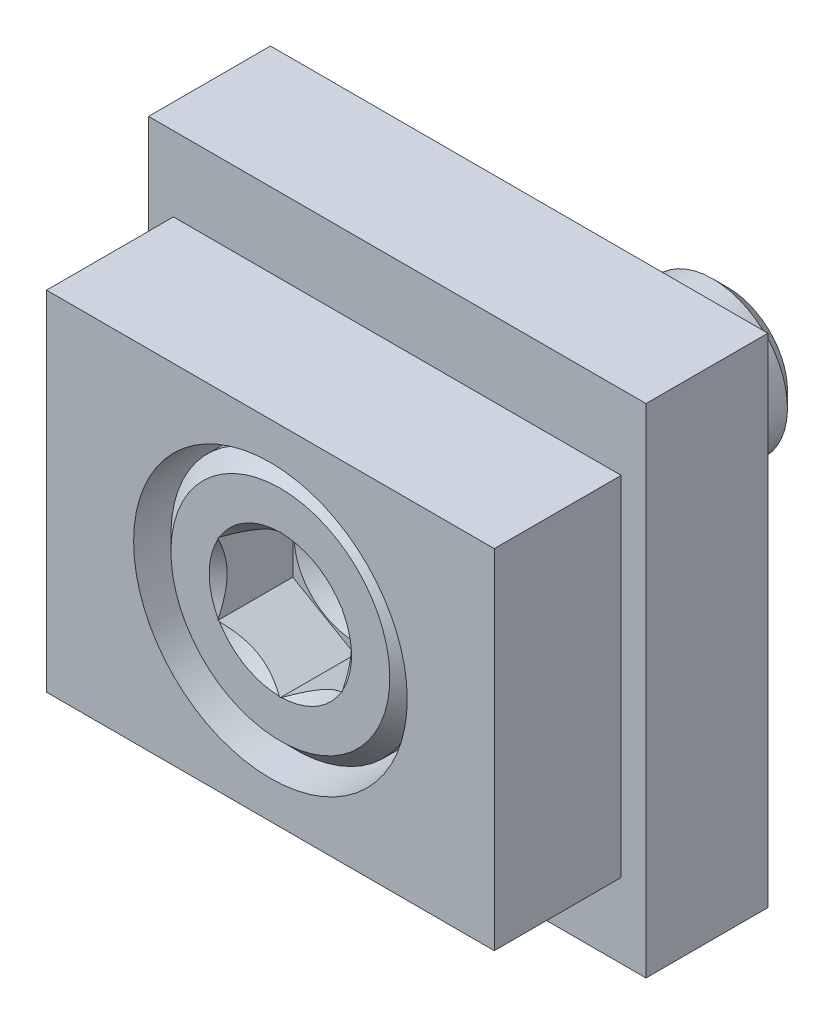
ISO-10303-21;
HEADER;
FILE_DESCRIPTION(('STEP AP214'),'2;1');
FILE_NAME('part.step','',(''),(''),'','','');
FILE_SCHEMA(('AUTOMOTIVE_DESIGN { 1 0 10303 214 1 1 1 1 }'));
ENDSEC;
DATA;
#1=APPLICATION_CONTEXT('core data for automotive mechanical design processes');
#2=APPLICATION_PROTOCOL_DEFINITION('international standard','automotive_design',2000,#1);
#3=PRODUCT_CONTEXT('',#1,'mechanical');
#4=PRODUCT('Part','Part','',(#3));
#5=PRODUCT_RELATED_PRODUCT_CATEGORY('part','',(#4));
#6=PRODUCT_DEFINITION_FORMATION('','',#4);
#7=PRODUCT_DEFINITION_CONTEXT('part definition',#1,'design');
#8=PRODUCT_DEFINITION('design','',#6,#7);
#9=PRODUCT_DEFINITION_SHAPE('','',#8);
#10=(LENGTH_UNIT() NAMED_UNIT(*) SI_UNIT(.MILLI.,.METRE.));
#11=(NAMED_UNIT(*) PLANE_ANGLE_UNIT() SI_UNIT($,.RADIAN.));
#12=(NAMED_UNIT(*) SI_UNIT($,.STERADIAN.) SOLID_ANGLE_UNIT());
#13=UNCERTAINTY_MEASURE_WITH_UNIT(LENGTH_MEASURE(1.E-05),#10,'distance_accuracy_value','');
#14=(GEOMETRIC_REPRESENTATION_CONTEXT(3) GLOBAL_UNCERTAINTY_ASSIGNED_CONTEXT((#13)) GLOBAL_UNIT_ASSIGNED_CONTEXT((#10,
#11,#12)) REPRESENTATION_CONTEXT('',''));
#15=CARTESIAN_POINT('',(0.,0.,0.));
#16=DIRECTION('',(0.,0.,1.));
#17=DIRECTION('',(1.,0.,0.));
#18=AXIS2_PLACEMENT_3D('',#15,#16,#17);
#19=CARTESIAN_POINT('',(2.3865,0.,-8.4));
#20=DIRECTION('',(0.,0.,1.));
#21=DIRECTION('',(1.,0.,0.));
#22=AXIS2_PLACEMENT_3D('',#19,#20,#21);
#23=PLANE('',#22);
#24=CARTESIAN_POINT('',(0.,0.,-8.4));
#25=DIRECTION('',(0.,0.,-1.));
#26=DIRECTION('',(0.,1.,0.));
#27=AXIS2_PLACEMENT_3D('',#24,#25,#26);
#28=CIRCLE('',#27,2.3865);
#29=CARTESIAN_POINT('',(0.,2.3865,-8.4));
#30=VERTEX_POINT('',#29);
#31=EDGE_CURVE('E883',#30,#30,#28,.T.);
#32=ORIENTED_EDGE('',*,*,#31,.T.);
#33=EDGE_LOOP('',(#32));
#34=FACE_BOUND('',#33,.T.);
#35=ADVANCED_FACE('F14',(#34),#23,.F.);
#36=CARTESIAN_POINT('',(0.,0.,-7.7865));
#37=DIRECTION('',(0.,0.,1.));
#38=DIRECTION('',(0.,-1.,0.));
#39=AXIS2_PLACEMENT_3D('',#36,#37,#38);
#40=CONICAL_SURFACE('',#39,3.,0.7853981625);
#41=ORIENTED_EDGE('',*,*,#31,.F.);
#42=EDGE_LOOP('',(#41));
#43=FACE_BOUND('',#42,.T.);
#44=CARTESIAN_POINT('',(0.,0.,-7.7865));
#45=DIRECTION('',(0.,0.,-1.));
#46=DIRECTION('',(0.,1.,0.));
#47=AXIS2_PLACEMENT_3D('',#44,#45,#46);
#48=CIRCLE('',#47,3.);
#49=CARTESIAN_POINT('',(0.,3.,-7.7865));
#50=VERTEX_POINT('',#49);
#51=EDGE_CURVE('E905',#50,#50,#48,.T.);
#52=ORIENTED_EDGE('',*,*,#51,.T.);
#53=EDGE_LOOP('',(#52));
#54=FACE_BOUND('',#53,.T.);
#55=ADVANCED_FACE('F619',(#43,#54),#40,.T.);
#56=CARTESIAN_POINT('',(0.,0.,3.6));
#57=DIRECTION('',(0.,0.,-1.));
#58=DIRECTION('',(0.,1.,0.));
#59=AXIS2_PLACEMENT_3D('',#56,#57,#58);
#60=CYLINDRICAL_SURFACE('',#59,3.);
#61=ORIENTED_EDGE('',*,*,#51,.F.);
#62=EDGE_LOOP('',(#61));
#63=FACE_BOUND('',#62,.T.);
#64=CARTESIAN_POINT('',(0.,0.,3.6));
#65=DIRECTION('',(0.,0.,-1.));
#66=DIRECTION('',(0.,1.,0.));
#67=AXIS2_PLACEMENT_3D('',#64,#65,#66);
#68=CIRCLE('',#67,3.);
#69=CARTESIAN_POINT('',(0.,3.,3.6));
#70=VERTEX_POINT('',#69);
#71=EDGE_CURVE('E879',#70,#70,#68,.T.);
#72=ORIENTED_EDGE('',*,*,#71,.T.);
#73=EDGE_LOOP('',(#72));
#74=FACE_BOUND('',#73,.T.);
#75=ADVANCED_FACE('F407',(#63,#74),#60,.T.);
#76=CARTESIAN_POINT('',(4.69,0.,3.6));
#77=DIRECTION('',(0.,0.,1.));
#78=DIRECTION('',(1.,0.,0.));
#79=AXIS2_PLACEMENT_3D('',#76,#77,#78);
#80=PLANE('',#79);
#81=ORIENTED_EDGE('',*,*,#71,.F.);
#82=EDGE_LOOP('',(#81));
#83=FACE_BOUND('',#82,.T.);
#84=CARTESIAN_POINT('',(0.,0.,3.6));
#85=DIRECTION('',(0.,0.,1.));
#86=DIRECTION('',(1.,0.,0.));
#87=AXIS2_PLACEMENT_3D('',#84,#85,#86);
#88=CIRCLE('',#87,3.3);
#89=CARTESIAN_POINT('',(3.3,0.,3.6));
#90=VERTEX_POINT('',#89);
#91=EDGE_CURVE('E9',#90,#90,#88,.T.);
#92=ORIENTED_EDGE('',*,*,#91,.F.);
#93=EDGE_LOOP('',(#92));
#94=FACE_BOUND('',#93,.T.);
#95=ADVANCED_FACE('F403',(#83,#94),#80,.F.);
#96=CARTESIAN_POINT('',(0.,0.,9.19));
#97=DIRECTION('',(0.,0.,1.));
#98=DIRECTION('',(0.,-1.,0.));
#99=AXIS2_PLACEMENT_3D('',#96,#97,#98);
#100=CONICAL_SURFACE('',#99,2.45,0.785398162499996);
#101=CARTESIAN_POINT('',(0.,0.,9.6));
#102=DIRECTION('',(0.,0.,-1.));
#103=DIRECTION('',(0.,1.,0.));
#104=AXIS2_PLACEMENT_3D('',#101,#102,#103);
#105=CIRCLE('',#104,2.86);
#106=CARTESIAN_POINT('',(-0.0470037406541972,-2.85961372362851,9.6));
#107=VERTEX_POINT('',#106);
#108=CARTESIAN_POINT('',(-2.45299625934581,-1.47051329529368,9.6));
#109=VERTEX_POINT('',#108);
#110=EDGE_CURVE('E38',#107,#109,#105,.T.);
#111=ORIENTED_EDGE('',*,*,#110,.F.);
#112=CARTESIAN_POINT('',(-0.047003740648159,-2.8596137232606,9.60000000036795));
#113=CARTESIAN_POINT('',(-0.0960797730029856,-2.83127575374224,9.57247848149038));
#114=CARTESIAN_POINT('',(-0.145612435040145,-2.80268798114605,9.54598950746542));
#115=CARTESIAN_POINT('',(-0.243979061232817,-2.74594253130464,9.49630136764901));
#116=CARTESIAN_POINT('',(-0.292782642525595,-2.71780150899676,9.47302278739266));
#117=CARTESIAN_POINT('',(-0.389910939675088,-2.66182010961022,9.42974375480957));
#118=CARTESIAN_POINT('',(-0.438210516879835,-2.63399353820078,9.40966951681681));
#119=CARTESIAN_POINT('',(-0.53456612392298,-2.5784839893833,9.37280301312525));
#120=CARTESIAN_POINT('',(-0.582603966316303,-2.55081141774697,9.35594804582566));
#121=CARTESIAN_POINT('',(-0.656982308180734,-2.5078792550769,9.33234443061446));
#122=CARTESIAN_POINT('',(-0.683087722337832,-2.49279481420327,9.32452566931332));
#123=CARTESIAN_POINT('',(-0.735037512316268,-2.46274559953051,9.3099345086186));
#124=CARTESIAN_POINT('',(-0.760878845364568,-2.44778311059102,9.3031466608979));
#125=CARTESIAN_POINT('',(-0.812367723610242,-2.41796603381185,9.29062096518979));
#126=CARTESIAN_POINT('',(-0.838012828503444,-2.40311291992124,9.28486960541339));
#127=CARTESIAN_POINT('',(-0.889171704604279,-2.37349136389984,9.27441329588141));
#128=CARTESIAN_POINT('',(-0.914683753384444,-2.35872382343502,9.2696973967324));
#129=CARTESIAN_POINT('',(-0.965638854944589,-2.329245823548,9.26130967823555));
#130=CARTESIAN_POINT('',(-0.991080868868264,-2.3145358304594,9.25762992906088));
#131=CARTESIAN_POINT('',(-1.04195640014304,-2.28513890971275,9.25131113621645));
#132=CARTESIAN_POINT('',(-1.06738946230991,-2.2704521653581,9.24866758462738));
#133=CARTESIAN_POINT('',(-1.11830607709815,-2.2410622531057,9.24441802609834));
#134=CARTESIAN_POINT('',(-1.14378957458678,-2.22635910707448,9.24281120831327));
#135=CARTESIAN_POINT('',(-1.19486287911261,-2.19688952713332,9.24062998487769));
#136=CARTESIAN_POINT('',(-1.22045277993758,-2.18212303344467,9.24005859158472));
#137=CARTESIAN_POINT('',(-1.27170421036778,-2.15253214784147,9.23994960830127));
#138=CARTESIAN_POINT('',(-1.29736572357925,-2.13770771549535,9.24041513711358));
#139=CARTESIAN_POINT('',(-1.34859834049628,-2.1081187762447,9.24240091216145));
#140=CARTESIAN_POINT('',(-1.37416951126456,-2.09335421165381,9.24391855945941));
#141=CARTESIAN_POINT('',(-1.42528936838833,-2.06385520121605,9.24800323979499));
#142=CARTESIAN_POINT('',(-1.45083798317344,-2.04912081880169,9.25057162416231));
#143=CARTESIAN_POINT('',(-1.50197785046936,-2.01964840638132,9.2567541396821));
#144=CARTESIAN_POINT('',(-1.52756867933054,-2.00491072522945,9.2603734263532));
#145=CARTESIAN_POINT('',(-1.57885400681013,-1.97539279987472,9.26865400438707));
#146=CARTESIAN_POINT('',(-1.60454751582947,-1.96061327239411,9.27332395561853));
#147=CARTESIAN_POINT('',(-1.65609495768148,-1.93096789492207,9.2837020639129));
#148=CARTESIAN_POINT('',(-1.68194714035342,-1.91610312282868,9.28942195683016));
#149=CARTESIAN_POINT('',(-1.73386520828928,-1.88624143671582,9.30189861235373));
#150=CARTESIAN_POINT('',(-1.75992843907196,-1.87124590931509,9.30866970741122));
#151=CARTESIAN_POINT('',(-1.81231409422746,-1.84106600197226,9.32324024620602));
#152=CARTESIAN_POINT('',(-1.83863279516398,-1.82588305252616,9.33105594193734));
#153=CARTESIAN_POINT('',(-1.91364180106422,-1.78255453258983,9.35468680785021));
#154=CARTESIAN_POINT('',(-1.96205669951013,-1.75451895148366,9.37158922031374));
#155=CARTESIAN_POINT('',(-2.05912873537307,-1.69830505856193,9.4085923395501));
#156=CARTESIAN_POINT('',(-2.1077680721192,-1.67013700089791,9.42875483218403));
#157=CARTESIAN_POINT('',(-2.20556448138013,-1.61352740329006,9.47224944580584));
#158=CARTESIAN_POINT('',(-2.25469719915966,-1.58510071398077,9.49565516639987));
#159=CARTESIAN_POINT('',(-2.35372131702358,-1.52784654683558,9.54563601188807));
#160=CARTESIAN_POINT('',(-2.40358318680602,-1.49903742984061,9.57229092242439));
#161=CARTESIAN_POINT('',(-2.4529962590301,-1.47051329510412,9.60000000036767));
#162=B_SPLINE_CURVE_WITH_KNOTS('',3,(#112,#113,#114,#115,#116,#117,#118,#119,#120,#121,#122,
#123,#124,#125,#126,#127,#128,#129,#130,#131,#132,#133,#134,#135,#136,#137,#138,#139,#140,#141,
#142,#143,#144,#145,#146,#147,#148,#149,#150,#151,#152,#153,#154,#155,#156,#157,#158,#159,#160,
#161),.UNSPECIFIED.,.F.,.F.,(4,2,2,2,2,2,2,2,2,2,2,2,2,2,2,2,2,2,2,2,2,2,2,2,4),(0.,
0.189012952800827,0.37182547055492,0.549496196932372,0.723242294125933,0.816672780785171,
0.908524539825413,0.99907516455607,1.08861645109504,1.17745258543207,1.26589783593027,
1.35427382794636,1.44290652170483,1.53180616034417,1.62048697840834,1.70928220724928,
1.79852062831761,1.88852343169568,1.97960139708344,2.07205252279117,2.16616018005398,
2.34140408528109,2.52047512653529,2.70461803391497,2.89491567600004),.UNSPECIFIED.);
#163=EDGE_CURVE('E25',#107,#109,#162,.T.);
#164=ORIENTED_EDGE('',*,*,#163,.T.);
#165=EDGE_LOOP('',(#111,#164));
#166=FACE_BOUND('',#165,.T.);
#167=ADVANCED_FACE('F406',(#166),#100,.F.);
#168=CARTESIAN_POINT('',(0.,0.,9.19));
#169=DIRECTION('',(0.,0.,1.));
#170=DIRECTION('',(0.,-1.,0.));
#171=AXIS2_PLACEMENT_3D('',#168,#169,#170);
#172=CONICAL_SURFACE('',#171,2.45,0.785398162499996);
#173=CARTESIAN_POINT('',(0.,0.,9.6));
#174=DIRECTION('',(0.,0.,-1.));
#175=DIRECTION('',(0.,1.,0.));
#176=AXIS2_PLACEMENT_3D('',#173,#174,#175);
#177=CIRCLE('',#176,2.86);
#178=CARTESIAN_POINT('',(2.45299625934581,-1.47051329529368,9.6));
#179=VERTEX_POINT('',#178);
#180=CARTESIAN_POINT('',(0.0470037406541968,-2.85961372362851,9.6));
#181=VERTEX_POINT('',#180);
#182=EDGE_CURVE('E813',#179,#181,#177,.T.);
#183=ORIENTED_EDGE('',*,*,#182,.F.);
#184=CARTESIAN_POINT('',(2.45299625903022,-1.47051329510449,9.60000000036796));
#185=CARTESIAN_POINT('',(2.40391684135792,-1.49884540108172,9.57247848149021));
#186=CARTESIAN_POINT('',(2.35439277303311,-1.52744805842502,9.54598950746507));
#187=CARTESIAN_POINT('',(2.2560664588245,-1.58426333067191,9.49630136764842));
#188=CARTESIAN_POINT('',(2.2072938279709,-1.61245796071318,9.473022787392));
#189=CARTESIAN_POINT('',(2.110248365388,-1.66858283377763,9.42974375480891));
#190=CARTESIAN_POINT('',(2.06200005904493,-1.69649820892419,9.4096695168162));
#191=CARTESIAN_POINT('',(1.96574957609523,-1.75218983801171,9.37280301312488));
#192=CARTESIAN_POINT('',(1.91776550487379,-1.77995554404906,9.35594804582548));
#193=CARTESIAN_POINT('',(1.8433959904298,-1.82290299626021,9.33234443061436));
#194=CARTESIAN_POINT('',(1.81727977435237,-1.83796872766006,9.32452566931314));
#195=CARTESIAN_POINT('',(1.765281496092,-1.86793395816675,9.30993450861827));
#196=CARTESIAN_POINT('',(1.73940293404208,-1.88283196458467,9.3031466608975));
#197=CARTESIAN_POINT('',(1.68783614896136,-1.91251410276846,9.29062096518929));
#198=CARTESIAN_POINT('',(1.66215042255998,-1.92729685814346,9.28486960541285));
#199=CARTESIAN_POINT('',(1.61091796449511,-1.95679096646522,9.27441329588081));
#200=CARTESIAN_POINT('',(1.58537287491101,-1.97150127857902,9.26969739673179));
#201=CARTESIAN_POINT('',(1.53436662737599,-2.00089069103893,9.26130967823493));
#202=CARTESIAN_POINT('',(1.50890639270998,-2.01556912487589,9.25762992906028));
#203=CARTESIAN_POINT('',(1.4580101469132,-2.04493016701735,9.2513111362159));
#204=CARTESIAN_POINT('',(1.43257452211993,-2.05961247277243,9.24866758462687));
#205=CARTESIAN_POINT('',(1.38166380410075,-2.08901259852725,9.24441802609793));
#206=CARTESIAN_POINT('',(1.35618875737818,-2.1037303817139,9.24281120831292));
#207=CARTESIAN_POINT('',(1.30513070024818,-2.13322637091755,9.24062998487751));
#208=CARTESIAN_POINT('',(1.27954759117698,-2.14800462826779,9.24005859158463));
#209=CARTESIAN_POINT('',(1.22829541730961,-2.17759422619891,9.23994960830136));
#210=CARTESIAN_POINT('',(1.20262632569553,-2.1924055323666,9.24041513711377));
#211=CARTESIAN_POINT('',(1.15138524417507,-2.22197981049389,9.2424009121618));
#212=CARTESIAN_POINT('',(1.12581317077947,-2.23674281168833,9.24391855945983));
#213=CARTESIAN_POINT('',(1.07470634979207,-2.26626440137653,9.2480032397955));
#214=CARTESIAN_POINT('',(1.04917169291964,-2.28102295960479,9.25057162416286));
#215=CARTESIAN_POINT('',(0.998077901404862,-2.31057517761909,9.25675413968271));
#216=CARTESIAN_POINT('',(0.972519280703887,-2.32536864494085,9.26037342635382));
#217=CARTESIAN_POINT('',(0.921313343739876,-2.35502407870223,9.26865400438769));
#218=CARTESIAN_POINT('',(0.895667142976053,-2.36988554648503,9.27332395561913));
#219=CARTESIAN_POINT('',(0.844219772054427,-2.39970425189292,9.28370206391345));
#220=CARTESIAN_POINT('',(0.818420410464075,-2.41466051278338,9.28942195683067));
#221=CARTESIAN_POINT('',(0.766600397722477,-2.44469203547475,9.30189861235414));
#222=CARTESIAN_POINT('',(0.740582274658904,-2.45976569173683,9.30866970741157));
#223=CARTESIAN_POINT('',(0.68825288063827,-2.49004304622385,9.3232402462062));
#224=CARTESIAN_POINT('',(0.661944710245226,-2.50524423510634,9.33105594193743));
#225=CARTESIAN_POINT('',(0.586916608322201,-2.54853967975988,9.35468680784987));
#226=CARTESIAN_POINT('',(0.538429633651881,-2.5764504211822,9.37158922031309));
#227=CARTESIAN_POINT('',(0.441210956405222,-2.63241032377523,9.40859233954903));
#228=CARTESIAN_POINT('',(0.392497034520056,-2.66044919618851,9.42875483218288));
#229=CARTESIAN_POINT('',(0.294573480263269,-2.71683857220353,9.4722494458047));
#230=CARTESIAN_POINT('',(0.245388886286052,-2.74517540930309,9.49565516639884));
#231=CARTESIAN_POINT('',(0.146293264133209,-2.80230572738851,9.54563601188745));
#232=CARTESIAN_POINT('',(0.0964129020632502,-2.83108281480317,9.57229092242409));
#233=CARTESIAN_POINT('',(0.0470037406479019,-2.85961372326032,9.60000000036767));
#234=B_SPLINE_CURVE_WITH_KNOTS('',3,(#184,#185,#186,#187,#188,#189,#190,#191,#192,#193,#194,
#195,#196,#197,#198,#199,#200,#201,#202,#203,#204,#205,#206,#207,#208,#209,#210,#211,#212,#213,
#214,#215,#216,#217,#218,#219,#220,#221,#222,#223,#224,#225,#226,#227,#228,#229,#230,#231,#232,
#233),.UNSPECIFIED.,.F.,.F.,(4,2,2,2,2,2,2,2,2,2,2,2,2,2,2,2,2,2,2,2,2,2,2,2,4),(0.,
0.189012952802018,0.371825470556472,0.549496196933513,0.723242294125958,0.816672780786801,
0.908524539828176,0.999075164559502,1.08861645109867,1.17745258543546,1.26589783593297,
1.35427382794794,1.44290652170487,1.53180616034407,1.62048697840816,1.70928220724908,
1.79852062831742,1.88852343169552,1.97960139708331,2.07205252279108,2.16616018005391,
2.34140408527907,2.52047512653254,2.70461803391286,2.89491567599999),.UNSPECIFIED.);
#235=EDGE_CURVE('E797',#179,#181,#234,.T.);
#236=ORIENTED_EDGE('',*,*,#235,.T.);
#237=EDGE_LOOP('',(#183,#236));
#238=FACE_BOUND('',#237,.T.);
#239=ADVANCED_FACE('F424',(#238),#172,.F.);
#240=CARTESIAN_POINT('',(0.,0.,9.19));
#241=DIRECTION('',(0.,0.,1.));
#242=DIRECTION('',(0.,-1.,0.));
#243=AXIS2_PLACEMENT_3D('',#240,#241,#242);
#244=CONICAL_SURFACE('',#243,2.45,0.785398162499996);
#245=CARTESIAN_POINT('',(0.,0.,9.6));
#246=DIRECTION('',(0.,0.,-1.));
#247=DIRECTION('',(0.,1.,0.));
#248=AXIS2_PLACEMENT_3D('',#245,#246,#247);
#249=CIRCLE('',#248,2.86);
#250=CARTESIAN_POINT('',(2.5,1.38910042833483,9.6));
#251=VERTEX_POINT('',#250);
#252=CARTESIAN_POINT('',(2.5,-1.38910042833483,9.6));
#253=VERTEX_POINT('',#252);
#254=EDGE_CURVE('E740',#251,#253,#249,.T.);
#255=ORIENTED_EDGE('',*,*,#254,.F.);
#256=CARTESIAN_POINT('',(2.49999999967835,1.38910042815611,9.60000000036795));
#257=CARTESIAN_POINT('',(2.49999638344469,1.33246505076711,9.57249494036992));
#258=CARTESIAN_POINT('',(2.5000112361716,1.27530773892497,9.54602612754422));
#259=CARTESIAN_POINT('',(2.50007065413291,1.16178290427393,9.49636791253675));
#260=CARTESIAN_POINT('',(2.50011424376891,1.10544953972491,9.47310018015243));
#261=CARTESIAN_POINT('',(2.50022297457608,0.993318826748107,9.42983248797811));
#262=CARTESIAN_POINT('',(2.50028748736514,0.937549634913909,9.40976003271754));
#263=CARTESIAN_POINT('',(2.50041446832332,0.826266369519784,9.37288700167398));
#264=CARTESIAN_POINT('',(2.5004769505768,0.770772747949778,9.35602518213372));
#265=CARTESIAN_POINT('',(2.50048962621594,0.684592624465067,9.3323478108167));
#266=CARTESIAN_POINT('',(2.50047816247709,0.654195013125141,9.3244701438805));
#267=CARTESIAN_POINT('',(2.50042432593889,0.593700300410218,9.30977743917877));
#268=CARTESIAN_POINT('',(2.50038249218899,0.563607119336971,9.30294635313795));
#269=CARTESIAN_POINT('',(2.50029327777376,0.503655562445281,9.29035078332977));
#270=CARTESIAN_POINT('',(2.50024598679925,0.473800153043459,9.28457221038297));
#271=CARTESIAN_POINT('',(2.50015822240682,0.414256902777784,9.27407795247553));
#272=CARTESIAN_POINT('',(2.50011767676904,0.384571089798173,9.26935079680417));
#273=CARTESIAN_POINT('',(2.50005183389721,0.325297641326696,9.26095698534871));
#274=CARTESIAN_POINT('',(2.50002641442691,0.29571119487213,9.25728195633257));
#275=CARTESIAN_POINT('',(2.49999262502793,0.236565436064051,9.25098899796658));
#276=CARTESIAN_POINT('',(2.49998417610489,0.207006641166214,9.24836621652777));
#277=CARTESIAN_POINT('',(2.49998012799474,0.147843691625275,9.24417423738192));
#278=CARTESIAN_POINT('',(2.4999845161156,0.118239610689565,9.24260400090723));
#279=CARTESIAN_POINT('',(2.4999949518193,0.0589126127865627,9.24051278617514));
#280=CARTESIAN_POINT('',(2.50000100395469,0.0291895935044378,9.23999471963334));
#281=CARTESIAN_POINT('',(2.49999899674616,-0.030232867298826,9.24000539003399));
#282=CARTESIAN_POINT('',(2.49999094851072,-0.0599323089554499,9.24053330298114));
#283=CARTESIAN_POINT('',(2.49997900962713,-0.119217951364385,9.24264512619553));
#284=CARTESIAN_POINT('',(2.49997510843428,-0.148804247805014,9.24422634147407));
#285=CARTESIAN_POINT('',(2.49998117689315,-0.20793748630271,9.24844036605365));
#286=CARTESIAN_POINT('',(2.49999116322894,-0.237484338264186,9.25107443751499));
#287=CARTESIAN_POINT('',(2.50002867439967,-0.296612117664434,9.25739027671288));
#288=CARTESIAN_POINT('',(2.50005628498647,-0.326192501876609,9.26107711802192));
#289=CARTESIAN_POINT('',(2.50012650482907,-0.385459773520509,9.26949481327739));
#290=CARTESIAN_POINT('',(2.50016923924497,-0.415145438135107,9.27423425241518));
#291=CARTESIAN_POINT('',(2.50026073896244,-0.474694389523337,9.28475332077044));
#292=CARTESIAN_POINT('',(2.50030956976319,-0.50455560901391,9.29054461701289));
#293=CARTESIAN_POINT('',(2.50040079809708,-0.564524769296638,9.30316605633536));
#294=CARTESIAN_POINT('',(2.50044308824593,-0.594629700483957,9.31001046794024));
#295=CARTESIAN_POINT('',(2.50049544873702,-0.65515409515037,9.32472963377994));
#296=CARTESIAN_POINT('',(2.50050493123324,-0.685569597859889,9.33262058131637));
#297=CARTESIAN_POINT('',(2.50048631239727,-0.77167798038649,9.35630284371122));
#298=CARTESIAN_POINT('',(2.50041982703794,-0.827083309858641,9.37315029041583));
#299=CARTESIAN_POINT('',(2.50028801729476,-0.938194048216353,9.40998856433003));
#300=CARTESIAN_POINT('',(2.50022275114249,-0.993878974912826,9.43004069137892));
#301=CARTESIAN_POINT('',(2.50011334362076,-1.10584457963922,9.47326068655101));
#302=CARTESIAN_POINT('',(2.50006985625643,-1.16209711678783,9.49650098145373));
#303=CARTESIAN_POINT('',(2.50001085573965,-1.27546278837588,9.54609761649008));
#304=CARTESIAN_POINT('',(2.4999963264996,-1.33254181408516,9.57253216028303));
#305=CARTESIAN_POINT('',(2.49999999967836,-1.38910042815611,9.60000000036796));
#306=B_SPLINE_CURVE_WITH_KNOTS('',3,(#256,#257,#258,#259,#260,#261,#262,#263,#264,#265,#266,
#267,#268,#269,#270,#271,#272,#273,#274,#275,#276,#277,#278,#279,#280,#281,#282,#283,#284,#285,
#286,#287,#288,#289,#290,#291,#292,#293,#294,#295,#296,#297,#298,#299,#300,#301,#302,#303,#304,
#305),.UNSPECIFIED.,.F.,.F.,(4,2,2,2,2,2,2,2,2,2,2,2,2,2,2,2,2,2,2,2,2,2,2,2,4),(0.,
0.188897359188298,0.371690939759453,0.549436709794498,0.723347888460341,0.817541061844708,
0.910102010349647,1.00131446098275,1.09147681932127,1.18090030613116,1.26990657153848,
1.35882486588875,1.44798889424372,1.53708270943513,1.62594943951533,1.71492302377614,
1.80433284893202,1.8945006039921,1.98573745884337,2.07834169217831,2.17259684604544,
2.3462424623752,2.52372996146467,2.70626825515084,2.89490959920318),.UNSPECIFIED.);
#307=EDGE_CURVE('E735',#251,#253,#306,.T.);
#308=ORIENTED_EDGE('',*,*,#307,.T.);
#309=EDGE_LOOP('',(#255,#308));
#310=FACE_BOUND('',#309,.T.);
#311=ADVANCED_FACE('F436',(#310),#244,.F.);
#312=CARTESIAN_POINT('',(0.,0.,9.19));
#313=DIRECTION('',(0.,0.,1.));
#314=DIRECTION('',(0.,-1.,0.));
#315=AXIS2_PLACEMENT_3D('',#312,#313,#314);
#316=CONICAL_SURFACE('',#315,2.45,0.785398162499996);
#317=CARTESIAN_POINT('',(0.,0.,9.6));
#318=DIRECTION('',(0.,0.,-1.));
#319=DIRECTION('',(0.,1.,0.));
#320=AXIS2_PLACEMENT_3D('',#317,#318,#319);
#321=CIRCLE('',#320,2.86);
#322=CARTESIAN_POINT('',(0.047003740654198,2.85961372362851,9.6));
#323=VERTEX_POINT('',#322);
#324=CARTESIAN_POINT('',(2.45299625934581,1.47051329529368,9.6));
#325=VERTEX_POINT('',#324);
#326=EDGE_CURVE('E964',#323,#325,#321,.T.);
#327=ORIENTED_EDGE('',*,*,#326,.F.);
#328=CARTESIAN_POINT('',(0.0470037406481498,2.8596137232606,9.60000000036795));
#329=CARTESIAN_POINT('',(0.0960797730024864,2.83127575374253,9.57247848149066));
#330=CARTESIAN_POINT('',(0.145612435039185,2.80268798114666,9.54598950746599));
#331=CARTESIAN_POINT('',(0.243979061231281,2.74594253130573,9.49630136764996));
#332=CARTESIAN_POINT('',(0.292782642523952,2.71780150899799,9.47302278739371));
#333=CARTESIAN_POINT('',(0.389910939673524,2.66182010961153,9.42974375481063));
#334=CARTESIAN_POINT('',(0.438210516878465,2.63399353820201,9.4096695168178));
#335=CARTESIAN_POINT('',(0.534566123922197,2.57848398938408,9.37280301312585));
#336=CARTESIAN_POINT('',(0.582603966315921,2.55081141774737,9.35594804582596));
#337=CARTESIAN_POINT('',(0.656982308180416,2.50787925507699,9.33234443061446));
#338=CARTESIAN_POINT('',(0.683087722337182,2.49279481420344,9.32452566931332));
#339=CARTESIAN_POINT('',(0.735037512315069,2.46274559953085,9.30993450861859));
#340=CARTESIAN_POINT('',(0.760878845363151,2.44778311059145,9.30314666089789));
#341=CARTESIAN_POINT('',(0.812367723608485,2.41796603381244,9.29062096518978));
#342=CARTESIAN_POINT('',(0.838012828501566,2.40311291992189,9.28486960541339));
#343=CARTESIAN_POINT('',(0.889171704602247,2.37349136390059,9.27441329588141));
#344=CARTESIAN_POINT('',(0.914683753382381,2.35872382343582,9.2696973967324));
#345=CARTESIAN_POINT('',(0.965638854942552,2.32924582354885,9.26130967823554));
#346=CARTESIAN_POINT('',(0.991080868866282,2.31453583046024,9.25762992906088));
#347=CARTESIAN_POINT('',(1.04195640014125,2.28513890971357,9.25131113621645));
#348=CARTESIAN_POINT('',(1.06738946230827,2.27045216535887,9.24866758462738));
#349=CARTESIAN_POINT('',(1.11830607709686,2.24106225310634,9.24441802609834));
#350=CARTESIAN_POINT('',(1.1437895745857,2.22635910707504,9.24281120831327));
#351=CARTESIAN_POINT('',(1.19486287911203,2.19688952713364,9.24062998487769));
#352=CARTESIAN_POINT('',(1.22045277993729,2.18212303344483,9.24005859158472));
#353=CARTESIAN_POINT('',(1.27170421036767,2.15253214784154,9.23994960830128));
#354=CARTESIAN_POINT('',(1.29736572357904,2.13770771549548,9.24041513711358));
#355=CARTESIAN_POINT('',(1.3485983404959,2.10811877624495,9.24240091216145));
#356=CARTESIAN_POINT('',(1.37416951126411,2.09335421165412,9.24391855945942));
#357=CARTESIAN_POINT('',(1.42528936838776,2.06385520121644,9.248003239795));
#358=CARTESIAN_POINT('',(1.45083798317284,2.04912081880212,9.25057162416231));
#359=CARTESIAN_POINT('',(1.50197785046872,2.0196484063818,9.2567541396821));
#360=CARTESIAN_POINT('',(1.52756867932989,2.00491072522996,9.26037342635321));
#361=CARTESIAN_POINT('',(1.57885400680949,1.97539279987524,9.26865400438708));
#362=CARTESIAN_POINT('',(1.60454751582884,1.96061327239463,9.27332395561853));
#363=CARTESIAN_POINT('',(1.65609495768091,1.93096789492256,9.2837020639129));
#364=CARTESIAN_POINT('',(1.6819471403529,1.91610312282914,9.28942195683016));
#365=CARTESIAN_POINT('',(1.73386520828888,1.8862414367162,9.30189861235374));
#366=CARTESIAN_POINT('',(1.75992843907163,1.87124590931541,9.30866970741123));
#367=CARTESIAN_POINT('',(1.81231409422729,1.84106600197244,9.32324024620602));
#368=CARTESIAN_POINT('',(1.83863279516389,1.82588305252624,9.33105594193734));
#369=CARTESIAN_POINT('',(1.91364180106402,1.78255453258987,9.3546868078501));
#370=CARTESIAN_POINT('',(1.96205669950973,1.75451895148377,9.37158922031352));
#371=CARTESIAN_POINT('',(2.05912873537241,1.69830505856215,9.40859233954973));
#372=CARTESIAN_POINT('',(2.10776807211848,1.67013700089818,9.42875483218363));
#373=CARTESIAN_POINT('',(2.20556448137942,1.61352740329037,9.47224944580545));
#374=CARTESIAN_POINT('',(2.25469719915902,1.58510071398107,9.49565516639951));
#375=CARTESIAN_POINT('',(2.3537213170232,1.52784654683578,9.54563601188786));
#376=CARTESIAN_POINT('',(2.40358318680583,1.49903742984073,9.57229092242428));
#377=CARTESIAN_POINT('',(2.4529962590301,1.47051329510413,9.60000000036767));
#378=B_SPLINE_CURVE_WITH_KNOTS('',3,(#328,#329,#330,#331,#332,#333,#334,#335,#336,#337,#338,
#339,#340,#341,#342,#343,#344,#345,#346,#347,#348,#349,#350,#351,#352,#353,#354,#355,#356,#357,
#358,#359,#360,#361,#362,#363,#364,#365,#366,#367,#368,#369,#370,#371,#372,#373,#374,#375,#376,
#377),.UNSPECIFIED.,.F.,.F.,(4,2,2,2,2,2,2,2,2,2,2,2,2,2,2,2,2,2,2,2,2,2,2,2,4),(0.,
0.189012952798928,0.371825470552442,0.549496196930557,0.723242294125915,0.816672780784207,
0.908524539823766,0.999075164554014,1.08861645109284,1.17745258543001,1.26589783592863,
1.35427382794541,1.44290652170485,1.53180616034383,1.62048697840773,1.70928220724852,
1.7985206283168,1.88852343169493,1.97960139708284,2.07205252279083,2.16616018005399,
2.34140408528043,2.52047512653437,2.70461803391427,2.89491567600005),.UNSPECIFIED.);
#379=EDGE_CURVE('E947',#323,#325,#378,.T.);
#380=ORIENTED_EDGE('',*,*,#379,.T.);
#381=EDGE_LOOP('',(#327,#380));
#382=FACE_BOUND('',#381,.T.);
#383=ADVANCED_FACE('F448',(#382),#316,.F.);
#384=CARTESIAN_POINT('',(0.,0.,9.19));
#385=DIRECTION('',(0.,0.,1.));
#386=DIRECTION('',(0.,-1.,0.));
#387=AXIS2_PLACEMENT_3D('',#384,#385,#386);
#388=CONICAL_SURFACE('',#387,2.45,0.785398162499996);
#389=CARTESIAN_POINT('',(0.,0.,9.6));
#390=DIRECTION('',(0.,0.,-1.));
#391=DIRECTION('',(0.,1.,0.));
#392=AXIS2_PLACEMENT_3D('',#389,#390,#391);
#393=CIRCLE('',#392,2.86);
#394=CARTESIAN_POINT('',(-2.45299625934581,1.47051329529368,9.6));
#395=VERTEX_POINT('',#394);
#396=CARTESIAN_POINT('',(-0.0470037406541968,2.85961372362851,9.6));
#397=VERTEX_POINT('',#396);
#398=EDGE_CURVE('E980',#395,#397,#393,.T.);
#399=ORIENTED_EDGE('',*,*,#398,.F.);
#400=CARTESIAN_POINT('',(-2.45299625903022,1.47051329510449,9.60000000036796));
#401=CARTESIAN_POINT('',(-2.40391684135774,1.49884540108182,9.57247848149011));
#402=CARTESIAN_POINT('',(-2.35439277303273,1.52744805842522,9.54598950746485));
#403=CARTESIAN_POINT('',(-2.25606645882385,1.58426333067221,9.49630136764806));
#404=CARTESIAN_POINT('',(-2.20729382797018,1.61245796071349,9.4730227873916));
#405=CARTESIAN_POINT('',(-2.11024836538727,1.6685828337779,9.4297437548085));
#406=CARTESIAN_POINT('',(-2.06200005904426,1.69649820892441,9.40966951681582));
#407=CARTESIAN_POINT('',(-1.96574957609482,1.75218983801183,9.37280301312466));
#408=CARTESIAN_POINT('',(-1.91776550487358,1.77995554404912,9.35594804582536));
#409=CARTESIAN_POINT('',(-1.84339599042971,1.8229029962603,9.33234443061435));
#410=CARTESIAN_POINT('',(-1.81727977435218,1.83796872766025,9.32452566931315));
#411=CARTESIAN_POINT('',(-1.76528149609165,1.86793395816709,9.30993450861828));
#412=CARTESIAN_POINT('',(-1.73940293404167,1.88283196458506,9.3031466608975));
#413=CARTESIAN_POINT('',(-1.68783614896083,1.91251410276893,9.29062096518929));
#414=CARTESIAN_POINT('',(-1.6621504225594,1.92729685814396,9.28486960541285));
#415=CARTESIAN_POINT('',(-1.61091796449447,1.95679096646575,9.27441329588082));
#416=CARTESIAN_POINT('',(-1.58537287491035,1.97150127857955,9.26969739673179));
#417=CARTESIAN_POINT('',(-1.53436662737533,2.00089069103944,9.26130967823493));
#418=CARTESIAN_POINT('',(-1.50890639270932,2.01556912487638,9.25762992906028));
#419=CARTESIAN_POINT('',(-1.45801014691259,2.04493016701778,9.25131113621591));
#420=CARTESIAN_POINT('',(-1.43257452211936,2.05961247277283,9.24866758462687));
#421=CARTESIAN_POINT('',(-1.38166380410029,2.08901259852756,9.24441802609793));
#422=CARTESIAN_POINT('',(-1.35618875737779,2.10373038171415,9.24281120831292));
#423=CARTESIAN_POINT('',(-1.30513070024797,2.13322637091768,9.2406299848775));
#424=CARTESIAN_POINT('',(-1.27954759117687,2.14800462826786,9.24005859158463));
#425=CARTESIAN_POINT('',(-1.22829541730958,2.17759422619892,9.23994960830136));
#426=CARTESIAN_POINT('',(-1.20262632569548,2.19240553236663,9.24041513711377));
#427=CARTESIAN_POINT('',(-1.15138524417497,2.22197981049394,9.2424009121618));
#428=CARTESIAN_POINT('',(-1.12581317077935,2.23674281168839,9.24391855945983));
#429=CARTESIAN_POINT('',(-1.07470634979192,2.2662644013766,9.2480032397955));
#430=CARTESIAN_POINT('',(-1.04917169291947,2.28102295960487,9.25057162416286));
#431=CARTESIAN_POINT('',(-0.998077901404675,2.31057517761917,9.25675413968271));
#432=CARTESIAN_POINT('',(-0.972519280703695,2.32536864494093,9.26037342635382));
#433=CARTESIAN_POINT('',(-0.921313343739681,2.3550240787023,9.26865400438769));
#434=CARTESIAN_POINT('',(-0.895667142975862,2.3698855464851,9.27332395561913));
#435=CARTESIAN_POINT('',(-0.84421977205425,2.39970425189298,9.28370206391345));
#436=CARTESIAN_POINT('',(-0.818420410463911,2.41466051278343,9.28942195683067));
#437=CARTESIAN_POINT('',(-0.766600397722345,2.44469203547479,9.30189861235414));
#438=CARTESIAN_POINT('',(-0.740582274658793,2.45976569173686,9.30866970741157));
#439=CARTESIAN_POINT('',(-0.688252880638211,2.49004304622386,9.3232402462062));
#440=CARTESIAN_POINT('',(-0.661944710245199,2.50524423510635,9.33105594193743));
#441=CARTESIAN_POINT('',(-0.586916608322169,2.54853967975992,9.3546868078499));
#442=CARTESIAN_POINT('',(-0.538429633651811,2.57645042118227,9.37158922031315));
#443=CARTESIAN_POINT('',(-0.441210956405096,2.63241032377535,9.40859233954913));
#444=CARTESIAN_POINT('',(-0.392497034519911,2.66044919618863,9.42875483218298));
#445=CARTESIAN_POINT('',(-0.294573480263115,2.71683857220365,9.4722494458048));
#446=CARTESIAN_POINT('',(-0.245388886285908,2.74517540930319,9.49565516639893));
#447=CARTESIAN_POINT('',(-0.146293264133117,2.80230572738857,9.54563601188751));
#448=CARTESIAN_POINT('',(-0.096412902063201,2.83108281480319,9.57229092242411));
#449=CARTESIAN_POINT('',(-0.047003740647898,2.85961372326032,9.60000000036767));
#450=B_SPLINE_CURVE_WITH_KNOTS('',3,(#400,#401,#402,#403,#404,#405,#406,#407,#408,#409,#410,
#411,#412,#413,#414,#415,#416,#417,#418,#419,#420,#421,#422,#423,#424,#425,#426,#427,#428,#429,
#430,#431,#432,#433,#434,#435,#436,#437,#438,#439,#440,#441,#442,#443,#444,#445,#446,#447,#448,
#449),.UNSPECIFIED.,.F.,.F.,(4,2,2,2,2,2,2,2,2,2,2,2,2,2,2,2,2,2,2,2,2,2,2,2,4),(0.,
0.189012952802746,0.371825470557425,0.549496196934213,0.723242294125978,0.816672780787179,
0.908524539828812,0.999075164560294,1.08861645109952,1.17745258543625,1.2658978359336,
1.35427382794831,1.44290652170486,1.53180616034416,1.62048697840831,1.70928220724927,
1.79852062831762,1.88852343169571,1.97960139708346,2.07205252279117,2.1661601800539,
2.34140408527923,2.52047512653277,2.70461803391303,2.89491567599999),.UNSPECIFIED.);
#451=EDGE_CURVE('E1013',#395,#397,#450,.T.);
#452=ORIENTED_EDGE('',*,*,#451,.T.);
#453=EDGE_LOOP('',(#399,#452));
#454=FACE_BOUND('',#453,.T.);
#455=ADVANCED_FACE('F460',(#454),#388,.F.);
#456=CARTESIAN_POINT('',(0.,0.,9.19));
#457=DIRECTION('',(0.,0.,1.));
#458=DIRECTION('',(0.,-1.,0.));
#459=AXIS2_PLACEMENT_3D('',#456,#457,#458);
#460=CONICAL_SURFACE('',#459,2.45,0.785398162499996);
#461=CARTESIAN_POINT('',(0.,0.,9.6));
#462=DIRECTION('',(0.,0.,-1.));
#463=DIRECTION('',(0.,1.,0.));
#464=AXIS2_PLACEMENT_3D('',#461,#462,#463);
#465=CIRCLE('',#464,2.86);
#466=CARTESIAN_POINT('',(-2.5,-1.38910042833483,9.6));
#467=VERTEX_POINT('',#466);
#468=CARTESIAN_POINT('',(-2.5,1.38910042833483,9.6));
#469=VERTEX_POINT('',#468);
#470=EDGE_CURVE('E829',#467,#469,#465,.T.);
#471=ORIENTED_EDGE('',*,*,#470,.F.);
#472=CARTESIAN_POINT('',(-2.49999999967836,-1.38910042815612,9.60000000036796));
#473=CARTESIAN_POINT('',(-2.49999637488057,-1.33255542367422,9.57253876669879));
#474=CARTESIAN_POINT('',(-2.50001207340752,-1.27548987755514,9.5461112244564));
#475=CARTESIAN_POINT('',(-2.50007396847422,-1.16214184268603,9.49652363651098));
#476=CARTESIAN_POINT('',(-2.50011916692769,-1.1058932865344,9.47328578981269));
#477=CARTESIAN_POINT('',(-2.50023104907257,-0.99392692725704,9.43006603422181));
#478=CARTESIAN_POINT('',(-2.50029710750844,-0.938237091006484,9.41001214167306));
#479=CARTESIAN_POINT('',(-2.50042648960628,-0.827108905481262,9.37316441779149));
#480=CARTESIAN_POINT('',(-2.50048984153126,-0.771690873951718,9.35630978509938));
#481=CARTESIAN_POINT('',(-2.50050301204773,-0.685585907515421,9.33262322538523));
#482=CARTESIAN_POINT('',(-2.50049151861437,-0.655186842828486,9.32473431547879));
#483=CARTESIAN_POINT('',(-2.50043721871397,-0.594690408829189,9.31001893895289));
#484=CARTESIAN_POINT('',(-2.50039495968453,-0.564596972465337,9.30317639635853));
#485=CARTESIAN_POINT('',(-2.50030462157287,-0.504646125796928,9.29055775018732));
#486=CARTESIAN_POINT('',(-2.50025663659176,-0.474791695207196,9.28476752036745));
#487=CARTESIAN_POINT('',(-2.50016732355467,-0.415251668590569,9.2742497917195));
#488=CARTESIAN_POINT('',(-2.50012592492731,-0.385568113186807,9.26951077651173));
#489=CARTESIAN_POINT('',(-2.50005833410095,-0.326300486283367,9.26109309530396));
#490=CARTESIAN_POINT('',(-2.50003201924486,-0.296717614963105,9.25740600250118));
#491=CARTESIAN_POINT('',(-2.49999653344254,-0.23758035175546,9.25108878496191));
#492=CARTESIAN_POINT('',(-2.49998728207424,-0.208026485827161,9.24845374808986));
#493=CARTESIAN_POINT('',(-2.49998180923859,-0.148874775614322,9.24423708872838));
#494=CARTESIAN_POINT('',(-2.49998557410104,-0.119277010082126,9.24265436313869));
#495=CARTESIAN_POINT('',(-2.49999523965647,-0.0599640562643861,9.24053816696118));
#496=CARTESIAN_POINT('',(-2.50000114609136,-0.0302487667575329,9.24000754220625));
#497=CARTESIAN_POINT('',(-2.49999885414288,0.0291736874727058,9.2399925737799));
#498=CARTESIAN_POINT('',(-2.49999065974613,0.0588808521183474,9.24050793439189));
#499=CARTESIAN_POINT('',(-2.49997795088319,0.118180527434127,9.24259478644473));
#500=CARTESIAN_POINT('',(-2.49997342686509,0.14777313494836,9.24416351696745));
#501=CARTESIAN_POINT('',(-2.49997807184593,0.206917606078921,9.2483528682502));
#502=CARTESIAN_POINT('',(-2.49998725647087,0.236469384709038,9.25097468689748));
#503=CARTESIAN_POINT('',(-2.50002307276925,0.295605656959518,9.25726627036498));
#504=CARTESIAN_POINT('',(-2.50004978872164,0.325189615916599,9.2609410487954));
#505=CARTESIAN_POINT('',(-2.50011826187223,0.384462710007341,9.26933487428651));
#506=CARTESIAN_POINT('',(-2.50016014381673,0.414150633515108,9.27406245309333));
#507=CARTESIAN_POINT('',(-2.50025009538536,0.473702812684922,9.28455804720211));
#508=CARTESIAN_POINT('',(-2.50029823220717,0.503565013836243,9.29033768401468));
#509=CARTESIAN_POINT('',(-2.5003883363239,0.563534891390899,9.30293604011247));
#510=CARTESIAN_POINT('',(-2.50043020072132,0.593639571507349,9.30976899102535));
#511=CARTESIAN_POINT('',(-2.5004820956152,0.654162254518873,9.32446547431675));
#512=CARTESIAN_POINT('',(-2.50049154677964,0.684576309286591,9.33234517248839));
#513=CARTESIAN_POINT('',(-2.50047341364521,0.770759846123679,9.3560182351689));
#514=CARTESIAN_POINT('',(-2.50040779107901,0.826240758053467,9.37287286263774));
#515=CARTESIAN_POINT('',(-2.50027837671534,0.937506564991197,9.40973643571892));
#516=CARTESIAN_POINT('',(-2.50021465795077,0.993270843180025,9.42980712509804));
#517=CARTESIAN_POINT('',(-2.5001084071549,1.10540079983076,9.47307505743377));
#518=CARTESIAN_POINT('',(-2.50006653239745,1.1617381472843,9.49634524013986));
#519=CARTESIAN_POINT('',(-2.50001001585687,1.27528063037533,9.54601250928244));
#520=CARTESIAN_POINT('',(-2.49999633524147,1.33245143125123,9.57248832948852));
#521=CARTESIAN_POINT('',(-2.49999999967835,1.38910042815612,9.60000000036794));
#522=B_SPLINE_CURVE_WITH_KNOTS('',3,(#472,#473,#474,#475,#476,#477,#478,#479,#480,#481,#482,
#483,#484,#485,#486,#487,#488,#489,#490,#491,#492,#493,#494,#495,#496,#497,#498,#499,#500,#501,
#502,#503,#504,#505,#506,#507,#508,#509,#510,#511,#512,#513,#514,#515,#516,#517,#518,#519,#520,
#521),.UNSPECIFIED.,.F.,.F.,(4,2,2,2,2,2,2,2,2,2,2,2,2,2,2,2,2,2,2,2,2,2,2,2,4),(0.,
0.188595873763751,0.371120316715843,0.548623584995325,0.722312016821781,0.816517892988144,
0.909087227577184,1.00030346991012,1.09046476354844,1.17988209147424,1.26887689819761,
1.35777826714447,1.44691977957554,1.53603609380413,1.62491973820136,1.71390477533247,
1.80332075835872,1.89348958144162,1.9847226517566,2.07731850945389,2.17156097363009,
2.34542931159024,2.52315930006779,2.70596673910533,2.89490960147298),.UNSPECIFIED.);
#523=EDGE_CURVE('E782',#467,#469,#522,.T.);
#524=ORIENTED_EDGE('',*,*,#523,.T.);
#525=EDGE_LOOP('',(#471,#524));
#526=FACE_BOUND('',#525,.T.);
#527=ADVANCED_FACE('F473',(#526),#460,.F.);
#528=CARTESIAN_POINT('',(2.86,0.,9.6));
#529=DIRECTION('',(0.,0.,-1.));
#530=DIRECTION('',(0.,1.,0.));
#531=AXIS2_PLACEMENT_3D('',#528,#529,#530);
#532=PLANE('',#531);
#533=CARTESIAN_POINT('',(0.,0.,9.6));
#534=DIRECTION('',(0.,0.,-1.));
#535=DIRECTION('',(0.,1.,0.));
#536=AXIS2_PLACEMENT_3D('',#533,#534,#535);
#537=CIRCLE('',#536,4.4);
#538=CARTESIAN_POINT('',(0.,4.4,9.6));
#539=VERTEX_POINT('',#538);
#540=EDGE_CURVE('E920',#539,#539,#537,.T.);
#541=ORIENTED_EDGE('',*,*,#540,.F.);
#542=EDGE_LOOP('',(#541));
#543=FACE_BOUND('',#542,.T.);
#544=DIRECTION('',(0.866025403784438,0.5,0.));
#545=VECTOR('',#544,1.);
#546=CARTESIAN_POINT('',(0.,-2.88675134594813,9.6));
#547=LINE('',#546,#545);
#548=CARTESIAN_POINT('',(0.,-2.88675134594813,9.6));
#549=VERTEX_POINT('',#548);
#550=EDGE_CURVE('E924',#549,#181,#547,.T.);
#551=ORIENTED_EDGE('',*,*,#550,.F.);
#552=DIRECTION('',(-0.866025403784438,0.5,0.));
#553=VECTOR('',#552,1.);
#554=CARTESIAN_POINT('',(0.895,-3.40347983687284,9.6));
#555=LINE('',#554,#553);
#556=EDGE_CURVE('E776',#549,#107,#555,.T.);
#557=ORIENTED_EDGE('',*,*,#556,.T.);
#558=ORIENTED_EDGE('',*,*,#110,.T.);
#559=DIRECTION('',(0.866025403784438,-0.5,0.));
#560=VECTOR('',#559,1.);
#561=CARTESIAN_POINT('',(-2.5,-1.44337567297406,9.6));
#562=LINE('',#561,#560);
#563=CARTESIAN_POINT('',(-2.5,-1.44337567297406,9.6));
#564=VERTEX_POINT('',#563);
#565=EDGE_CURVE('E785',#564,#109,#562,.T.);
#566=ORIENTED_EDGE('',*,*,#565,.F.);
#567=DIRECTION('',(0.,1.,0.));
#568=VECTOR('',#567,1.);
#569=CARTESIAN_POINT('',(-2.5,0.,9.6));
#570=LINE('',#569,#568);
#571=EDGE_CURVE('E777',#564,#467,#570,.T.);
#572=ORIENTED_EDGE('',*,*,#571,.T.);
#573=ORIENTED_EDGE('',*,*,#470,.T.);
#574=DIRECTION('',(0.,-1.,0.));
#575=VECTOR('',#574,1.);
#576=CARTESIAN_POINT('',(-2.5,1.44337567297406,9.6));
#577=LINE('',#576,#575);
#578=CARTESIAN_POINT('',(-2.5,1.44337567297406,9.6));
#579=VERTEX_POINT('',#578);
#580=EDGE_CURVE('E846',#579,#469,#577,.T.);
#581=ORIENTED_EDGE('',*,*,#580,.F.);
#582=DIRECTION('',(0.866025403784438,0.5,0.));
#583=VECTOR('',#582,1.);
#584=CARTESIAN_POINT('',(0.895,3.40347983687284,9.6));
#585=LINE('',#584,#583);
#586=EDGE_CURVE('E838',#579,#395,#585,.T.);
#587=ORIENTED_EDGE('',*,*,#586,.T.);
#588=ORIENTED_EDGE('',*,*,#398,.T.);
#589=DIRECTION('',(-0.866025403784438,-0.5,0.));
#590=VECTOR('',#589,1.);
#591=CARTESIAN_POINT('',(0.,2.88675134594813,9.6));
#592=LINE('',#591,#590);
#593=CARTESIAN_POINT('',(0.,2.88675134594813,9.6));
#594=VERTEX_POINT('',#593);
#595=EDGE_CURVE('E860',#594,#397,#592,.T.);
#596=ORIENTED_EDGE('',*,*,#595,.F.);
#597=DIRECTION('',(0.866025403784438,-0.5,0.));
#598=VECTOR('',#597,1.);
#599=CARTESIAN_POINT('',(3.395,0.926647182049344,9.6));
#600=LINE('',#599,#598);
#601=EDGE_CURVE('E988',#594,#323,#600,.T.);
#602=ORIENTED_EDGE('',*,*,#601,.T.);
#603=ORIENTED_EDGE('',*,*,#326,.T.);
#604=DIRECTION('',(-0.866025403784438,0.5,0.));
#605=VECTOR('',#604,1.);
#606=CARTESIAN_POINT('',(2.5,1.44337567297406,9.6));
#607=LINE('',#606,#605);
#608=CARTESIAN_POINT('',(2.5,1.44337567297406,9.6));
#609=VERTEX_POINT('',#608);
#610=EDGE_CURVE('E888',#609,#325,#607,.T.);
#611=ORIENTED_EDGE('',*,*,#610,.F.);
#612=DIRECTION('',(0.,-1.,0.));
#613=VECTOR('',#612,1.);
#614=CARTESIAN_POINT('',(2.5,0.,9.6));
#615=LINE('',#614,#613);
#616=EDGE_CURVE('E1083',#609,#251,#615,.T.);
#617=ORIENTED_EDGE('',*,*,#616,.T.);
#618=ORIENTED_EDGE('',*,*,#254,.T.);
#619=DIRECTION('',(0.,1.,0.));
#620=VECTOR('',#619,1.);
#621=CARTESIAN_POINT('',(2.5,-1.44337567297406,9.6));
#622=LINE('',#621,#620);
#623=CARTESIAN_POINT('',(2.5,-1.44337567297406,9.6));
#624=VERTEX_POINT('',#623);
#625=EDGE_CURVE('E887',#624,#253,#622,.T.);
#626=ORIENTED_EDGE('',*,*,#625,.F.);
#627=DIRECTION('',(-0.866025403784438,-0.5,0.));
#628=VECTOR('',#627,1.);
#629=CARTESIAN_POINT('',(3.395,-0.926647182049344,9.6));
#630=LINE('',#629,#628);
#631=EDGE_CURVE('E1087',#624,#179,#630,.T.);
#632=ORIENTED_EDGE('',*,*,#631,.T.);
#633=ORIENTED_EDGE('',*,*,#182,.T.);
#634=EDGE_LOOP('',(#551,#557,#558,#566,#572,#573,#581,#587,#588,#596,#602,#603,#611,#617,#618,
#626,#632,#633));
#635=FACE_BOUND('',#634,.T.);
#636=ADVANCED_FACE('F484',(#543,#635),#532,.F.);
#637=CARTESIAN_POINT('',(0.,0.,9.6));
#638=DIRECTION('',(0.,0.,-1.));
#639=DIRECTION('',(0.,1.,0.));
#640=AXIS2_PLACEMENT_3D('',#637,#638,#639);
#641=CONICAL_SURFACE('',#640,4.4,0.785398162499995);
#642=CARTESIAN_POINT('',(0.,0.,9.));
#643=DIRECTION('',(0.,0.,-1.));
#644=DIRECTION('',(0.,1.,0.));
#645=AXIS2_PLACEMENT_3D('',#642,#643,#644);
#646=CIRCLE('',#645,5.);
#647=CARTESIAN_POINT('',(0.,5.,9.));
#648=VERTEX_POINT('',#647);
#649=EDGE_CURVE('E917',#648,#648,#646,.T.);
#650=ORIENTED_EDGE('',*,*,#649,.F.);
#651=EDGE_LOOP('',(#650));
#652=FACE_BOUND('',#651,.T.);
#653=ORIENTED_EDGE('',*,*,#540,.T.);
#654=EDGE_LOOP('',(#653));
#655=FACE_BOUND('',#654,.T.);
#656=ADVANCED_FACE('F496',(#652,#655),#641,.T.);
#657=CARTESIAN_POINT('',(0.,0.,3.6));
#658=DIRECTION('',(0.,0.,-1.));
#659=DIRECTION('',(0.,1.,0.));
#660=AXIS2_PLACEMENT_3D('',#657,#658,#659);
#661=CYLINDRICAL_SURFACE('',#660,5.);
#662=CARTESIAN_POINT('',(0.,0.,3.91));
#663=DIRECTION('',(0.,0.,-1.));
#664=DIRECTION('',(0.,1.,0.));
#665=AXIS2_PLACEMENT_3D('',#662,#663,#664);
#666=CIRCLE('',#665,5.);
#667=CARTESIAN_POINT('',(0.,5.,3.91));
#668=VERTEX_POINT('',#667);
#669=EDGE_CURVE('E916',#668,#668,#666,.T.);
#670=ORIENTED_EDGE('',*,*,#669,.F.);
#671=EDGE_LOOP('',(#670));
#672=FACE_BOUND('',#671,.T.);
#673=ORIENTED_EDGE('',*,*,#649,.T.);
#674=EDGE_LOOP('',(#673));
#675=FACE_BOUND('',#674,.T.);
#676=ADVANCED_FACE('F508',(#672,#675),#661,.T.);
#677=CARTESIAN_POINT('',(0.,0.,3.91));
#678=DIRECTION('',(0.,0.,1.));
#679=DIRECTION('',(0.,-1.,0.));
#680=AXIS2_PLACEMENT_3D('',#677,#678,#679);
#681=CONICAL_SURFACE('',#680,5.,0.785398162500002);
#682=CARTESIAN_POINT('',(0.,0.,3.6));
#683=DIRECTION('',(0.,0.,-1.));
#684=DIRECTION('',(0.,1.,0.));
#685=AXIS2_PLACEMENT_3D('',#682,#683,#684);
#686=CIRCLE('',#685,4.69);
#687=CARTESIAN_POINT('',(0.,4.69,3.6));
#688=VERTEX_POINT('',#687);
#689=EDGE_CURVE('E912',#688,#688,#686,.T.);
#690=ORIENTED_EDGE('',*,*,#689,.F.);
#691=EDGE_LOOP('',(#690));
#692=FACE_BOUND('',#691,.T.);
#693=ORIENTED_EDGE('',*,*,#669,.T.);
#694=EDGE_LOOP('',(#693));
#695=FACE_BOUND('',#694,.T.);
#696=ADVANCED_FACE('F520',(#692,#695),#681,.T.);
#697=CARTESIAN_POINT('',(-2.5,-1.44337567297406,6.6));
#698=DIRECTION('',(-0.5,-0.866025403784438,0.));
#699=DIRECTION('',(0.,0.,1.));
#700=AXIS2_PLACEMENT_3D('',#697,#698,#699);
#701=PLANE('',#700);
#702=ORIENTED_EDGE('',*,*,#556,.F.);
#703=DIRECTION('',(0.,0.,1.));
#704=VECTOR('',#703,1.);
#705=CARTESIAN_POINT('',(0.,-2.88675134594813,6.6));
#706=LINE('',#705,#704);
#707=CARTESIAN_POINT('',(0.,-2.88675134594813,6.6));
#708=VERTEX_POINT('',#707);
#709=EDGE_CURVE('E789',#708,#549,#706,.T.);
#710=ORIENTED_EDGE('',*,*,#709,.F.);
#711=DIRECTION('',(0.866025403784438,-0.5,0.));
#712=VECTOR('',#711,1.);
#713=CARTESIAN_POINT('',(-2.5,-1.44337567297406,6.6));
#714=LINE('',#713,#712);
#715=CARTESIAN_POINT('',(-2.5,-1.44337567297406,6.6));
#716=VERTEX_POINT('',#715);
#717=EDGE_CURVE('E851',#716,#708,#714,.T.);
#718=ORIENTED_EDGE('',*,*,#717,.F.);
#719=DIRECTION('',(0.,0.,1.));
#720=VECTOR('',#719,1.);
#721=CARTESIAN_POINT('',(-2.5,-1.44337567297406,6.6));
#722=LINE('',#721,#720);
#723=EDGE_CURVE('E788',#716,#564,#722,.T.);
#724=ORIENTED_EDGE('',*,*,#723,.T.);
#725=ORIENTED_EDGE('',*,*,#565,.T.);
#726=ORIENTED_EDGE('',*,*,#163,.F.);
#727=EDGE_LOOP('',(#702,#710,#718,#724,#725,#726));
#728=FACE_BOUND('',#727,.T.);
#729=ADVANCED_FACE('F532',(#728),#701,.F.);
#730=CARTESIAN_POINT('',(0.,-2.88675134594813,6.6));
#731=DIRECTION('',(0.5,-0.866025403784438,0.));
#732=DIRECTION('',(0.,0.,-1.));
#733=AXIS2_PLACEMENT_3D('',#730,#731,#732);
#734=PLANE('',#733);
#735=ORIENTED_EDGE('',*,*,#631,.F.);
#736=DIRECTION('',(0.,0.,1.));
#737=VECTOR('',#736,1.);
#738=CARTESIAN_POINT('',(2.5,-1.44337567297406,6.6));
#739=LINE('',#738,#737);
#740=CARTESIAN_POINT('',(2.5,-1.44337567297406,6.6));
#741=VERTEX_POINT('',#740);
#742=EDGE_CURVE('E921',#741,#624,#739,.T.);
#743=ORIENTED_EDGE('',*,*,#742,.F.);
#744=DIRECTION('',(0.866025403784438,0.5,0.));
#745=VECTOR('',#744,1.);
#746=CARTESIAN_POINT('',(0.,-2.88675134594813,6.6));
#747=LINE('',#746,#745);
#748=EDGE_CURVE('E864',#708,#741,#747,.T.);
#749=ORIENTED_EDGE('',*,*,#748,.F.);
#750=ORIENTED_EDGE('',*,*,#709,.T.);
#751=ORIENTED_EDGE('',*,*,#550,.T.);
#752=ORIENTED_EDGE('',*,*,#235,.F.);
#753=EDGE_LOOP('',(#735,#743,#749,#750,#751,#752));
#754=FACE_BOUND('',#753,.T.);
#755=ADVANCED_FACE('F542',(#754),#734,.F.);
#756=CARTESIAN_POINT('',(2.5,-1.44337567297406,6.6));
#757=DIRECTION('',(1.,0.,0.));
#758=DIRECTION('',(0.,0.,1.));
#759=AXIS2_PLACEMENT_3D('',#756,#757,#758);
#760=PLANE('',#759);
#761=ORIENTED_EDGE('',*,*,#616,.F.);
#762=DIRECTION('',(0.,0.,1.));
#763=VECTOR('',#762,1.);
#764=CARTESIAN_POINT('',(2.5,1.44337567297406,6.6));
#765=LINE('',#764,#763);
#766=CARTESIAN_POINT('',(2.5,1.44337567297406,6.6));
#767=VERTEX_POINT('',#766);
#768=EDGE_CURVE('E884',#767,#609,#765,.T.);
#769=ORIENTED_EDGE('',*,*,#768,.F.);
#770=DIRECTION('',(0.,1.,0.));
#771=VECTOR('',#770,1.);
#772=CARTESIAN_POINT('',(2.5,-1.44337567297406,6.6));
#773=LINE('',#772,#771);
#774=EDGE_CURVE('E875',#741,#767,#773,.T.);
#775=ORIENTED_EDGE('',*,*,#774,.F.);
#776=ORIENTED_EDGE('',*,*,#742,.T.);
#777=ORIENTED_EDGE('',*,*,#625,.T.);
#778=ORIENTED_EDGE('',*,*,#307,.F.);
#779=EDGE_LOOP('',(#761,#769,#775,#776,#777,#778));
#780=FACE_BOUND('',#779,.T.);
#781=ADVANCED_FACE('F553',(#780),#760,.F.);
#782=CARTESIAN_POINT('',(2.5,1.44337567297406,6.6));
#783=DIRECTION('',(0.5,0.866025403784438,0.));
#784=DIRECTION('',(0.,0.,-1.));
#785=AXIS2_PLACEMENT_3D('',#782,#783,#784);
#786=PLANE('',#785);
#787=ORIENTED_EDGE('',*,*,#601,.F.);
#788=DIRECTION('',(0.,0.,1.));
#789=VECTOR('',#788,1.);
#790=CARTESIAN_POINT('',(0.,2.88675134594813,6.6));
#791=LINE('',#790,#789);
#792=CARTESIAN_POINT('',(0.,2.88675134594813,6.6));
#793=VERTEX_POINT('',#792);
#794=EDGE_CURVE('E894',#793,#594,#791,.T.);
#795=ORIENTED_EDGE('',*,*,#794,.F.);
#796=DIRECTION('',(-0.866025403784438,0.5,0.));
#797=VECTOR('',#796,1.);
#798=CARTESIAN_POINT('',(2.5,1.44337567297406,6.6));
#799=LINE('',#798,#797);
#800=EDGE_CURVE('E893',#767,#793,#799,.T.);
#801=ORIENTED_EDGE('',*,*,#800,.F.);
#802=ORIENTED_EDGE('',*,*,#768,.T.);
#803=ORIENTED_EDGE('',*,*,#610,.T.);
#804=ORIENTED_EDGE('',*,*,#379,.F.);
#805=EDGE_LOOP('',(#787,#795,#801,#802,#803,#804));
#806=FACE_BOUND('',#805,.T.);
#807=ADVANCED_FACE('F564',(#806),#786,.F.);
#808=CARTESIAN_POINT('',(0.,2.88675134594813,6.6));
#809=DIRECTION('',(-0.5,0.866025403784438,0.));
#810=DIRECTION('',(-0.866025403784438,-0.5,0.));
#811=AXIS2_PLACEMENT_3D('',#808,#809,#810);
#812=PLANE('',#811);
#813=ORIENTED_EDGE('',*,*,#586,.F.);
#814=DIRECTION('',(0.,0.,1.));
#815=VECTOR('',#814,1.);
#816=CARTESIAN_POINT('',(-2.5,1.44337567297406,6.6));
#817=LINE('',#816,#815);
#818=CARTESIAN_POINT('',(-2.5,1.44337567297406,6.6));
#819=VERTEX_POINT('',#818);
#820=EDGE_CURVE('E850',#819,#579,#817,.T.);
#821=ORIENTED_EDGE('',*,*,#820,.F.);
#822=DIRECTION('',(-0.866025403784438,-0.5,0.));
#823=VECTOR('',#822,1.);
#824=CARTESIAN_POINT('',(0.,2.88675134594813,6.6));
#825=LINE('',#824,#823);
#826=EDGE_CURVE('E901',#793,#819,#825,.T.);
#827=ORIENTED_EDGE('',*,*,#826,.F.);
#828=ORIENTED_EDGE('',*,*,#794,.T.);
#829=ORIENTED_EDGE('',*,*,#595,.T.);
#830=ORIENTED_EDGE('',*,*,#451,.F.);
#831=EDGE_LOOP('',(#813,#821,#827,#828,#829,#830));
#832=FACE_BOUND('',#831,.T.);
#833=ADVANCED_FACE('F574',(#832),#812,.F.);
#834=CARTESIAN_POINT('',(-2.5,1.44337567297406,6.6));
#835=DIRECTION('',(-1.,0.,0.));
#836=DIRECTION('',(0.,-1.,0.));
#837=AXIS2_PLACEMENT_3D('',#834,#835,#836);
#838=PLANE('',#837);
#839=ORIENTED_EDGE('',*,*,#571,.F.);
#840=ORIENTED_EDGE('',*,*,#723,.F.);
#841=DIRECTION('',(0.,-1.,0.));
#842=VECTOR('',#841,1.);
#843=CARTESIAN_POINT('',(-2.5,1.44337567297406,6.6));
#844=LINE('',#843,#842);
#845=EDGE_CURVE('E904',#819,#716,#844,.T.);
#846=ORIENTED_EDGE('',*,*,#845,.F.);
#847=ORIENTED_EDGE('',*,*,#820,.T.);
#848=ORIENTED_EDGE('',*,*,#580,.T.);
#849=ORIENTED_EDGE('',*,*,#523,.F.);
#850=EDGE_LOOP('',(#839,#840,#846,#847,#848,#849));
#851=FACE_BOUND('',#850,.T.);
#852=ADVANCED_FACE('F584',(#851),#838,.F.);
#853=CARTESIAN_POINT('',(0.,-2.88675134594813,6.6));
#854=DIRECTION('',(0.,0.,1.));
#855=DIRECTION('',(1.,0.,0.));
#856=AXIS2_PLACEMENT_3D('',#853,#854,#855);
#857=PLANE('',#856);
#858=ORIENTED_EDGE('',*,*,#717,.T.);
#859=ORIENTED_EDGE('',*,*,#748,.T.);
#860=ORIENTED_EDGE('',*,*,#774,.T.);
#861=ORIENTED_EDGE('',*,*,#800,.T.);
#862=ORIENTED_EDGE('',*,*,#826,.T.);
#863=ORIENTED_EDGE('',*,*,#845,.T.);
#864=EDGE_LOOP('',(#858,#859,#860,#861,#862,#863));
#865=FACE_BOUND('',#864,.T.);
#866=CARTESIAN_POINT('',(0.,0.,6.6));
#867=DIRECTION('',(0.,0.,-1.));
#868=DIRECTION('',(0.,-1.,0.));
#869=AXIS2_PLACEMENT_3D('',#866,#867,#868);
#870=CIRCLE('',#869,2.45);
#871=CARTESIAN_POINT('',(0.,-2.45,6.6));
#872=VERTEX_POINT('',#871);
#873=EDGE_CURVE('E195',#872,#872,#870,.T.);
#874=ORIENTED_EDGE('',*,*,#873,.T.);
#875=EDGE_LOOP('',(#874));
#876=FACE_BOUND('',#875,.T.);
#877=ADVANCED_FACE('F594',(#865,#876),#857,.T.);
#878=CARTESIAN_POINT('',(0.,0.,6.18549184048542));
#879=DIRECTION('',(0.,0.,1.));
#880=DIRECTION('',(0.,-1.,0.));
#881=AXIS2_PLACEMENT_3D('',#878,#879,#880);
#882=CONICAL_SURFACE('',#881,1.7320508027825,1.04719755);
#883=ORIENTED_EDGE('',*,*,#873,.F.);
#884=EDGE_LOOP('',(#883));
#885=FACE_BOUND('',#884,.T.);
#886=CARTESIAN_POINT('',(0.,0.,5.18549184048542));
#887=VERTEX_POINT('',#886);
#888=VERTEX_LOOP('',#887);
#889=FACE_BOUND('',#888,.T.);
#890=ADVANCED_FACE('F336',(#885,#889),#882,.F.);
#891=CARTESIAN_POINT('',(-9.,-7.,10.));
#892=DIRECTION('',(0.,1.,0.));
#893=DIRECTION('',(1.,0.,0.));
#894=AXIS2_PLACEMENT_3D('',#891,#892,#893);
#895=PLANE('',#894);
#896=DIRECTION('',(-1.,0.,0.));
#897=VECTOR('',#896,1.);
#898=CARTESIAN_POINT('',(-9.,-7.,4.9));
#899=LINE('',#898,#897);
#900=CARTESIAN_POINT('',(9.,-7.,4.9));
#901=VERTEX_POINT('',#900);
#902=CARTESIAN_POINT('',(-9.,-7.,4.9));
#903=VERTEX_POINT('',#902);
#904=EDGE_CURVE('E146',#901,#903,#899,.T.);
#905=ORIENTED_EDGE('',*,*,#904,.F.);
#906=DIRECTION('',(0.,0.,1.));
#907=VECTOR('',#906,1.);
#908=CARTESIAN_POINT('',(9.,-7.,10.));
#909=LINE('',#908,#907);
#910=CARTESIAN_POINT('',(9.,-7.,10.));
#911=VERTEX_POINT('',#910);
#912=EDGE_CURVE('E143',#901,#911,#909,.T.);
#913=ORIENTED_EDGE('',*,*,#912,.T.);
#914=DIRECTION('',(1.,0.,0.));
#915=VECTOR('',#914,1.);
#916=CARTESIAN_POINT('',(-9.,-7.,10.));
#917=LINE('',#916,#915);
#918=CARTESIAN_POINT('',(-9.,-7.,10.));
#919=VERTEX_POINT('',#918);
#920=EDGE_CURVE('E127',#919,#911,#917,.T.);
#921=ORIENTED_EDGE('',*,*,#920,.F.);
#922=DIRECTION('',(0.,0.,1.));
#923=VECTOR('',#922,1.);
#924=CARTESIAN_POINT('',(-9.,-7.,10.));
#925=LINE('',#924,#923);
#926=EDGE_CURVE('E149',#903,#919,#925,.T.);
#927=ORIENTED_EDGE('',*,*,#926,.F.);
#928=EDGE_LOOP('',(#905,#913,#921,#927));
#929=FACE_BOUND('',#928,.T.);
#930=ADVANCED_FACE('F144',(#929),#895,.F.);
#931=CARTESIAN_POINT('',(-9.,7.,10.));
#932=DIRECTION('',(1.,0.,0.));
#933=DIRECTION('',(0.,1.,0.));
#934=AXIS2_PLACEMENT_3D('',#931,#932,#933);
#935=PLANE('',#934);
#936=DIRECTION('',(0.,1.,0.));
#937=VECTOR('',#936,1.);
#938=CARTESIAN_POINT('',(-9.,7.,4.9));
#939=LINE('',#938,#937);
#940=CARTESIAN_POINT('',(-9.,7.,4.9));
#941=VERTEX_POINT('',#940);
#942=EDGE_CURVE('E169',#903,#941,#939,.T.);
#943=ORIENTED_EDGE('',*,*,#942,.F.);
#944=ORIENTED_EDGE('',*,*,#926,.T.);
#945=DIRECTION('',(0.,-1.,0.));
#946=VECTOR('',#945,1.);
#947=CARTESIAN_POINT('',(-9.,7.,10.));
#948=LINE('',#947,#946);
#949=CARTESIAN_POINT('',(-9.,7.,10.));
#950=VERTEX_POINT('',#949);
#951=EDGE_CURVE('E134',#950,#919,#948,.T.);
#952=ORIENTED_EDGE('',*,*,#951,.F.);
#953=DIRECTION('',(0.,0.,1.));
#954=VECTOR('',#953,1.);
#955=CARTESIAN_POINT('',(-9.,7.,10.));
#956=LINE('',#955,#954);
#957=EDGE_CURVE('E163',#941,#950,#956,.T.);
#958=ORIENTED_EDGE('',*,*,#957,.F.);
#959=EDGE_LOOP('',(#943,#944,#952,#958));
#960=FACE_BOUND('',#959,.T.);
#961=ADVANCED_FACE('F320',(#960),#935,.F.);
#962=CARTESIAN_POINT('',(9.,7.,10.));
#963=DIRECTION('',(0.,-1.,0.));
#964=DIRECTION('',(0.,0.,-1.));
#965=AXIS2_PLACEMENT_3D('',#962,#963,#964);
#966=PLANE('',#965);
#967=DIRECTION('',(1.,0.,0.));
#968=VECTOR('',#967,1.);
#969=CARTESIAN_POINT('',(9.,7.,4.9));
#970=LINE('',#969,#968);
#971=CARTESIAN_POINT('',(9.,7.,4.9));
#972=VERTEX_POINT('',#971);
#973=EDGE_CURVE('E173',#941,#972,#970,.T.);
#974=ORIENTED_EDGE('',*,*,#973,.F.);
#975=ORIENTED_EDGE('',*,*,#957,.T.);
#976=DIRECTION('',(-1.,0.,0.));
#977=VECTOR('',#976,1.);
#978=CARTESIAN_POINT('',(9.,7.,10.));
#979=LINE('',#978,#977);
#980=CARTESIAN_POINT('',(9.,7.,10.));
#981=VERTEX_POINT('',#980);
#982=EDGE_CURVE('E157',#981,#950,#979,.T.);
#983=ORIENTED_EDGE('',*,*,#982,.F.);
#984=DIRECTION('',(0.,0.,1.));
#985=VECTOR('',#984,1.);
#986=CARTESIAN_POINT('',(9.,7.,10.));
#987=LINE('',#986,#985);
#988=EDGE_CURVE('E150',#972,#981,#987,.T.);
#989=ORIENTED_EDGE('',*,*,#988,.F.);
#990=EDGE_LOOP('',(#974,#975,#983,#989));
#991=FACE_BOUND('',#990,.T.);
#992=ADVANCED_FACE('F313',(#991),#966,.F.);
#993=CARTESIAN_POINT('',(9.,-7.,10.));
#994=DIRECTION('',(-1.,0.,0.));
#995=DIRECTION('',(0.,0.,1.));
#996=AXIS2_PLACEMENT_3D('',#993,#994,#995);
#997=PLANE('',#996);
#998=DIRECTION('',(0.,-1.,0.));
#999=VECTOR('',#998,1.);
#1000=CARTESIAN_POINT('',(9.,-7.,4.9));
#1001=LINE('',#1000,#999);
#1002=EDGE_CURVE('E199',#972,#901,#1001,.T.);
#1003=ORIENTED_EDGE('',*,*,#1002,.F.);
#1004=ORIENTED_EDGE('',*,*,#988,.T.);
#1005=DIRECTION('',(0.,1.,0.));
#1006=VECTOR('',#1005,1.);
#1007=CARTESIAN_POINT('',(9.,-7.,10.));
#1008=LINE('',#1007,#1006);
#1009=EDGE_CURVE('E132',#911,#981,#1008,.T.);
#1010=ORIENTED_EDGE('',*,*,#1009,.F.);
#1011=ORIENTED_EDGE('',*,*,#912,.F.);
#1012=EDGE_LOOP('',(#1003,#1004,#1010,#1011));
#1013=FACE_BOUND('',#1012,.T.);
#1014=ADVANCED_FACE('F152',(#1013),#997,.F.);
#1015=CARTESIAN_POINT('',(0.,0.,10.));
#1016=DIRECTION('',(0.,0.,1.));
#1017=DIRECTION('',(1.,0.,0.));
#1018=AXIS2_PLACEMENT_3D('',#1015,#1016,#1017);
#1019=PLANE('',#1018);
#1020=CARTESIAN_POINT('',(0.,0.,10.));
#1021=DIRECTION('',(0.,0.,-1.));
#1022=DIRECTION('',(-1.,0.,0.));
#1023=AXIS2_PLACEMENT_3D('',#1020,#1021,#1022);
#1024=CIRCLE('',#1023,5.5);
#1025=CARTESIAN_POINT('',(-5.5,0.,10.));
#1026=VERTEX_POINT('',#1025);
#1027=EDGE_CURVE('E156',#1026,#1026,#1024,.T.);
#1028=ORIENTED_EDGE('',*,*,#1027,.T.);
#1029=EDGE_LOOP('',(#1028));
#1030=FACE_BOUND('',#1029,.T.);
#1031=ORIENTED_EDGE('',*,*,#1009,.T.);
#1032=ORIENTED_EDGE('',*,*,#982,.T.);
#1033=ORIENTED_EDGE('',*,*,#951,.T.);
#1034=ORIENTED_EDGE('',*,*,#920,.T.);
#1035=EDGE_LOOP('',(#1031,#1032,#1033,#1034));
#1036=FACE_BOUND('',#1035,.T.);
#1037=ADVANCED_FACE('F129',(#1030,#1036),#1019,.T.);
#1038=CARTESIAN_POINT('',(0.,0.,10.));
#1039=DIRECTION('',(0.,0.,-1.));
#1040=DIRECTION('',(-1.,0.,0.));
#1041=AXIS2_PLACEMENT_3D('',#1038,#1039,#1040);
#1042=CYLINDRICAL_SURFACE('',#1041,5.5);
#1043=CARTESIAN_POINT('',(0.,0.,3.6));
#1044=DIRECTION('',(0.,0.,1.));
#1045=DIRECTION('',(-1.,0.,0.));
#1046=AXIS2_PLACEMENT_3D('',#1043,#1044,#1045);
#1047=CIRCLE('',#1046,5.5);
#1048=CARTESIAN_POINT('',(-5.5,0.,3.6));
#1049=VERTEX_POINT('',#1048);
#1050=EDGE_CURVE('E139',#1049,#1049,#1047,.T.);
#1051=ORIENTED_EDGE('',*,*,#1050,.F.);
#1052=EDGE_LOOP('',(#1051));
#1053=FACE_BOUND('',#1052,.T.);
#1054=ORIENTED_EDGE('',*,*,#1027,.F.);
#1055=EDGE_LOOP('',(#1054));
#1056=FACE_BOUND('',#1055,.T.);
#1057=ADVANCED_FACE('F280',(#1053,#1056),#1042,.F.);
#1058=CARTESIAN_POINT('',(0.,0.,3.6));
#1059=DIRECTION('',(0.,0.,-1.));
#1060=DIRECTION('',(0.,-1.,0.));
#1061=AXIS2_PLACEMENT_3D('',#1058,#1059,#1060);
#1062=PLANE('',#1061);
#1063=ORIENTED_EDGE('',*,*,#689,.T.);
#1064=EDGE_LOOP('',(#1063));
#1065=FACE_BOUND('',#1064,.T.);
#1066=ORIENTED_EDGE('',*,*,#1050,.T.);
#1067=EDGE_LOOP('',(#1066));
#1068=FACE_BOUND('',#1067,.T.);
#1069=ADVANCED_FACE('F285',(#1065,#1068),#1062,.F.);
#1070=CARTESIAN_POINT('',(-9.,-7.,4.9));
#1071=DIRECTION('',(0.,0.,1.));
#1072=DIRECTION('',(1.,0.,0.));
#1073=AXIS2_PLACEMENT_3D('',#1070,#1071,#1072);
#1074=PLANE('',#1073);
#1075=ORIENTED_EDGE('',*,*,#904,.T.);
#1076=ORIENTED_EDGE('',*,*,#942,.T.);
#1077=ORIENTED_EDGE('',*,*,#973,.T.);
#1078=ORIENTED_EDGE('',*,*,#1002,.T.);
#1079=EDGE_LOOP('',(#1075,#1076,#1077,#1078));
#1080=FACE_BOUND('',#1079,.T.);
#1081=DIRECTION('',(1.,0.,0.));
#1082=VECTOR('',#1081,1.);
#1083=CARTESIAN_POINT('',(-10.,-10.,4.9));
#1084=LINE('',#1083,#1082);
#1085=CARTESIAN_POINT('',(-10.,-10.,4.9));
#1086=VERTEX_POINT('',#1085);
#1087=CARTESIAN_POINT('',(10.,-10.,4.9));
#1088=VERTEX_POINT('',#1087);
#1089=EDGE_CURVE('E208',#1086,#1088,#1084,.T.);
#1090=ORIENTED_EDGE('',*,*,#1089,.T.);
#1091=DIRECTION('',(0.,1.,0.));
#1092=VECTOR('',#1091,1.);
#1093=CARTESIAN_POINT('',(10.,-10.,4.9));
#1094=LINE('',#1093,#1092);
#1095=CARTESIAN_POINT('',(10.,10.,4.9));
#1096=VERTEX_POINT('',#1095);
#1097=EDGE_CURVE('E18',#1088,#1096,#1094,.T.);
#1098=ORIENTED_EDGE('',*,*,#1097,.T.);
#1099=DIRECTION('',(-1.,0.,0.));
#1100=VECTOR('',#1099,1.);
#1101=CARTESIAN_POINT('',(10.,10.,4.9));
#1102=LINE('',#1101,#1100);
#1103=CARTESIAN_POINT('',(-10.,10.,4.9));
#1104=VERTEX_POINT('',#1103);
#1105=EDGE_CURVE('E205',#1096,#1104,#1102,.T.);
#1106=ORIENTED_EDGE('',*,*,#1105,.T.);
#1107=DIRECTION('',(0.,-1.,0.));
#1108=VECTOR('',#1107,1.);
#1109=CARTESIAN_POINT('',(-10.,10.,4.9));
#1110=LINE('',#1109,#1108);
#1111=EDGE_CURVE('E202',#1104,#1086,#1110,.T.);
#1112=ORIENTED_EDGE('',*,*,#1111,.T.);
#1113=EDGE_LOOP('',(#1090,#1098,#1106,#1112));
#1114=FACE_BOUND('',#1113,.T.);
#1115=ADVANCED_FACE('F16',(#1080,#1114),#1074,.T.);
#1116=CARTESIAN_POINT('',(-10.,-10.,10.));
#1117=DIRECTION('',(0.,1.,0.));
#1118=DIRECTION('',(1.,0.,0.));
#1119=AXIS2_PLACEMENT_3D('',#1116,#1117,#1118);
#1120=PLANE('',#1119);
#1121=DIRECTION('',(0.,0.,-1.));
#1122=VECTOR('',#1121,1.);
#1123=CARTESIAN_POINT('',(10.,-10.,10.));
#1124=LINE('',#1123,#1122);
#1125=CARTESIAN_POINT('',(10.,-10.,0.));
#1126=VERTEX_POINT('',#1125);
#1127=EDGE_CURVE('E180',#1088,#1126,#1124,.T.);
#1128=ORIENTED_EDGE('',*,*,#1127,.F.);
#1129=ORIENTED_EDGE('',*,*,#1089,.F.);
#1130=DIRECTION('',(0.,0.,-1.));
#1131=VECTOR('',#1130,1.);
#1132=CARTESIAN_POINT('',(-10.,-10.,10.));
#1133=LINE('',#1132,#1131);
#1134=CARTESIAN_POINT('',(-10.,-10.,0.));
#1135=VERTEX_POINT('',#1134);
#1136=EDGE_CURVE('E191',#1086,#1135,#1133,.T.);
#1137=ORIENTED_EDGE('',*,*,#1136,.T.);
#1138=DIRECTION('',(1.,0.,0.));
#1139=VECTOR('',#1138,1.);
#1140=CARTESIAN_POINT('',(-10.,-10.,0.));
#1141=LINE('',#1140,#1139);
#1142=EDGE_CURVE('E168',#1135,#1126,#1141,.T.);
#1143=ORIENTED_EDGE('',*,*,#1142,.T.);
#1144=EDGE_LOOP('',(#1128,#1129,#1137,#1143));
#1145=FACE_BOUND('',#1144,.T.);
#1146=ADVANCED_FACE('F272',(#1145),#1120,.F.);
#1147=CARTESIAN_POINT('',(10.,-10.,10.));
#1148=DIRECTION('',(-1.,0.,0.));
#1149=DIRECTION('',(0.,0.,1.));
#1150=AXIS2_PLACEMENT_3D('',#1147,#1148,#1149);
#1151=PLANE('',#1150);
#1152=DIRECTION('',(0.,0.,-1.));
#1153=VECTOR('',#1152,1.);
#1154=CARTESIAN_POINT('',(10.,10.,10.));
#1155=LINE('',#1154,#1153);
#1156=CARTESIAN_POINT('',(10.,10.,0.));
#1157=VERTEX_POINT('',#1156);
#1158=EDGE_CURVE('E178',#1096,#1157,#1155,.T.);
#1159=ORIENTED_EDGE('',*,*,#1158,.F.);
#1160=ORIENTED_EDGE('',*,*,#1097,.F.);
#1161=ORIENTED_EDGE('',*,*,#1127,.T.);
#1162=DIRECTION('',(0.,1.,0.));
#1163=VECTOR('',#1162,1.);
#1164=CARTESIAN_POINT('',(10.,-10.,0.));
#1165=LINE('',#1164,#1163);
#1166=EDGE_CURVE('E182',#1126,#1157,#1165,.T.);
#1167=ORIENTED_EDGE('',*,*,#1166,.T.);
#1168=EDGE_LOOP('',(#1159,#1160,#1161,#1167));
#1169=FACE_BOUND('',#1168,.T.);
#1170=ADVANCED_FACE('F238',(#1169),#1151,.F.);
#1171=CARTESIAN_POINT('',(10.,10.,10.));
#1172=DIRECTION('',(0.,-1.,0.));
#1173=DIRECTION('',(0.,0.,-1.));
#1174=AXIS2_PLACEMENT_3D('',#1171,#1172,#1173);
#1175=PLANE('',#1174);
#1176=DIRECTION('',(0.,0.,-1.));
#1177=VECTOR('',#1176,1.);
#1178=CARTESIAN_POINT('',(-10.,10.,10.));
#1179=LINE('',#1178,#1177);
#1180=CARTESIAN_POINT('',(-10.,10.,0.));
#1181=VERTEX_POINT('',#1180);
#1182=EDGE_CURVE('E190',#1104,#1181,#1179,.T.);
#1183=ORIENTED_EDGE('',*,*,#1182,.F.);
#1184=ORIENTED_EDGE('',*,*,#1105,.F.);
#1185=ORIENTED_EDGE('',*,*,#1158,.T.);
#1186=DIRECTION('',(-1.,0.,0.));
#1187=VECTOR('',#1186,1.);
#1188=CARTESIAN_POINT('',(10.,10.,0.));
#1189=LINE('',#1188,#1187);
#1190=EDGE_CURVE('E174',#1157,#1181,#1189,.T.);
#1191=ORIENTED_EDGE('',*,*,#1190,.T.);
#1192=EDGE_LOOP('',(#1183,#1184,#1185,#1191));
#1193=FACE_BOUND('',#1192,.T.);
#1194=ADVANCED_FACE('F248',(#1193),#1175,.F.);
#1195=CARTESIAN_POINT('',(-10.,10.,10.));
#1196=DIRECTION('',(1.,0.,0.));
#1197=DIRECTION('',(0.,1.,0.));
#1198=AXIS2_PLACEMENT_3D('',#1195,#1196,#1197);
#1199=PLANE('',#1198);
#1200=ORIENTED_EDGE('',*,*,#1136,.F.);
#1201=ORIENTED_EDGE('',*,*,#1111,.F.);
#1202=ORIENTED_EDGE('',*,*,#1182,.T.);
#1203=DIRECTION('',(0.,-1.,0.));
#1204=VECTOR('',#1203,1.);
#1205=CARTESIAN_POINT('',(-10.,10.,0.));
#1206=LINE('',#1205,#1204);
#1207=EDGE_CURVE('E186',#1181,#1135,#1206,.T.);
#1208=ORIENTED_EDGE('',*,*,#1207,.T.);
#1209=EDGE_LOOP('',(#1200,#1201,#1202,#1208));
#1210=FACE_BOUND('',#1209,.T.);
#1211=ADVANCED_FACE('F359',(#1210),#1199,.F.);
#1212=CARTESIAN_POINT('',(0.,0.,0.));
#1213=DIRECTION('',(0.,0.,1.));
#1214=DIRECTION('',(1.,0.,0.));
#1215=AXIS2_PLACEMENT_3D('',#1212,#1213,#1214);
#1216=PLANE('',#1215);
#1217=CARTESIAN_POINT('',(0.,0.,0.));
#1218=DIRECTION('',(0.,0.,1.));
#1219=DIRECTION('',(1.,0.,0.));
#1220=AXIS2_PLACEMENT_3D('',#1217,#1218,#1219);
#1221=CIRCLE('',#1220,3.3);
#1222=CARTESIAN_POINT('',(3.3,0.,0.));
#1223=VERTEX_POINT('',#1222);
#1224=EDGE_CURVE('E179',#1223,#1223,#1221,.T.);
#1225=ORIENTED_EDGE('',*,*,#1224,.T.);
#1226=EDGE_LOOP('',(#1225));
#1227=FACE_BOUND('',#1226,.T.);
#1228=ORIENTED_EDGE('',*,*,#1207,.F.);
#1229=ORIENTED_EDGE('',*,*,#1190,.F.);
#1230=ORIENTED_EDGE('',*,*,#1166,.F.);
#1231=ORIENTED_EDGE('',*,*,#1142,.F.);
#1232=EDGE_LOOP('',(#1228,#1229,#1230,#1231));
#1233=FACE_BOUND('',#1232,.T.);
#1234=ADVANCED_FACE('F245',(#1227,#1233),#1216,.F.);
#1235=CARTESIAN_POINT('',(0.,0.,-11.5));
#1236=DIRECTION('',(0.,0.,-1.));
#1237=DIRECTION('',(-1.,0.,0.));
#1238=AXIS2_PLACEMENT_3D('',#1235,#1236,#1237);
#1239=CYLINDRICAL_SURFACE('',#1238,3.3);
#1240=ORIENTED_EDGE('',*,*,#91,.T.);
#1241=EDGE_LOOP('',(#1240));
#1242=FACE_BOUND('',#1241,.T.);
#1243=ORIENTED_EDGE('',*,*,#1224,.F.);
#1244=EDGE_LOOP('',(#1243));
#1245=FACE_BOUND('',#1244,.T.);
#1246=ADVANCED_FACE('F297',(#1242,#1245),#1239,.F.);
#1247=CLOSED_SHELL('',(#35,#55,#75,#95,#167,#239,#311,#383,#455,#527,#636,#656,#676,#696,#729,
#755,#781,#807,#833,#852,#877,#890,#930,#961,#992,#1014,#1037,#1057,#1069,#1115,#1146,#1170,
#1194,#1211,#1234,#1246));
#1248=MANIFOLD_SOLID_BREP('B1',#1247);
#1249=ADVANCED_BREP_SHAPE_REPRESENTATION('',(#18,#1248),#14);
#1250=SHAPE_DEFINITION_REPRESENTATION(#9,#1249);
ENDSEC;
END-ISO-10303-21;
